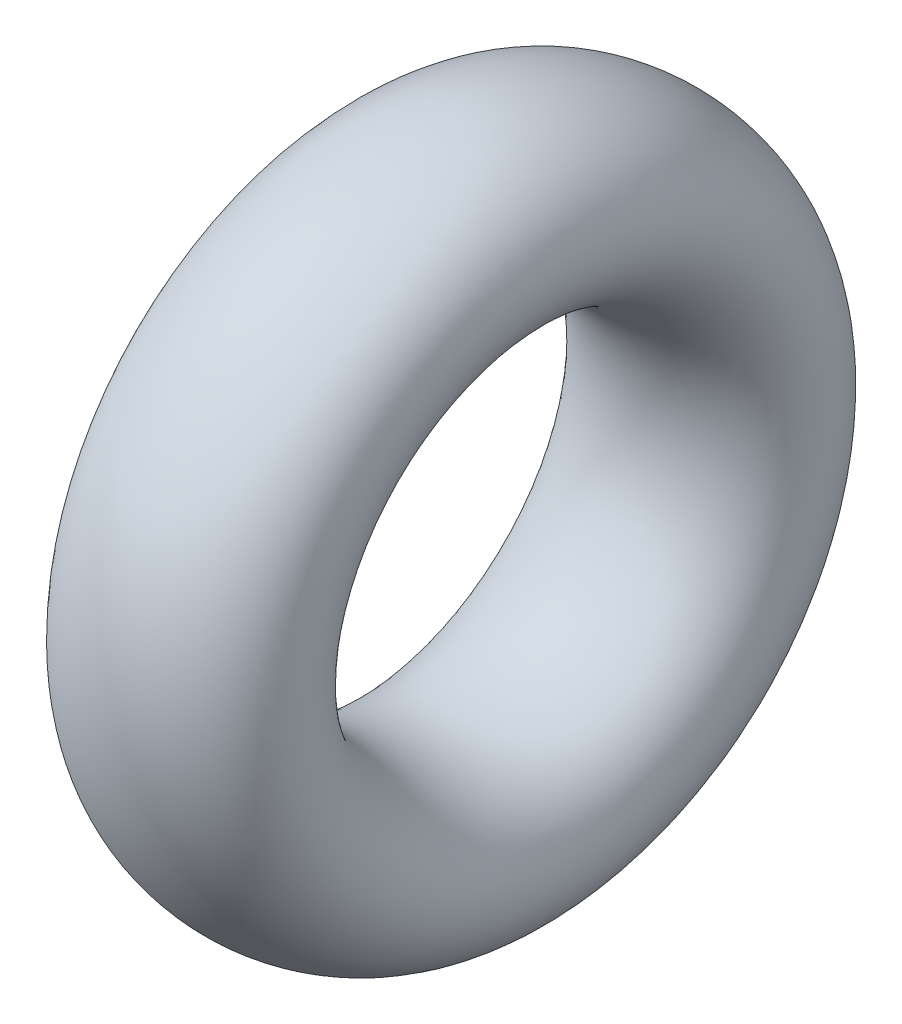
from build123d import *

# Parameters (mm, degrees)
ESQUISSE1_RX = 2
ESQUISSE1_RY = 1.5


with BuildPart() as part:
    # Esquisse1 → Base-R_volution (revolve)
    with BuildSketch(Plane.XY):
        with Locations(Location((101, 4.5), (0, 0, 180))):
            Ellipse(ESQUISSE1_RX, ESQUISSE1_RY)
    revolve(axis=Axis((110.288869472, 0, 0), (-1, 0, 0)))


solid = part.part
